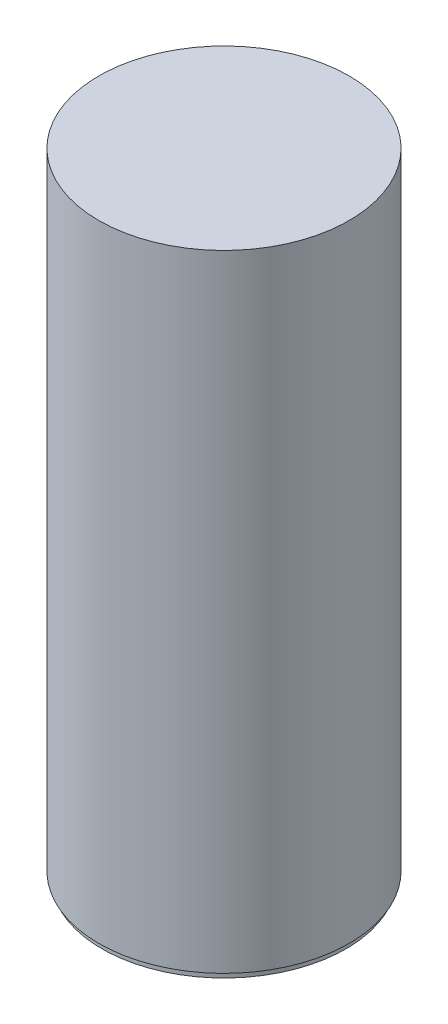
ISO-10303-21;
HEADER;
FILE_DESCRIPTION(('STEP AP214'),'2;1');
FILE_NAME('part.step','',(''),(''),'','','');
FILE_SCHEMA(('AUTOMOTIVE_DESIGN { 1 0 10303 214 1 1 1 1 }'));
ENDSEC;
DATA;
#1=APPLICATION_CONTEXT('core data for automotive mechanical design processes');
#2=APPLICATION_PROTOCOL_DEFINITION('international standard','automotive_design',2000,#1);
#3=PRODUCT_CONTEXT('',#1,'mechanical');
#4=PRODUCT('Part','Part','',(#3));
#5=PRODUCT_RELATED_PRODUCT_CATEGORY('part','',(#4));
#6=PRODUCT_DEFINITION_FORMATION('','',#4);
#7=PRODUCT_DEFINITION_CONTEXT('part definition',#1,'design');
#8=PRODUCT_DEFINITION('design','',#6,#7);
#9=PRODUCT_DEFINITION_SHAPE('','',#8);
#10=(LENGTH_UNIT() NAMED_UNIT(*) SI_UNIT(.MILLI.,.METRE.));
#11=(NAMED_UNIT(*) PLANE_ANGLE_UNIT() SI_UNIT($,.RADIAN.));
#12=(NAMED_UNIT(*) SI_UNIT($,.STERADIAN.) SOLID_ANGLE_UNIT());
#13=UNCERTAINTY_MEASURE_WITH_UNIT(LENGTH_MEASURE(1.E-05),#10,'distance_accuracy_value','');
#14=(GEOMETRIC_REPRESENTATION_CONTEXT(3) GLOBAL_UNCERTAINTY_ASSIGNED_CONTEXT((#13)) GLOBAL_UNIT_ASSIGNED_CONTEXT((#10,
#11,#12)) REPRESENTATION_CONTEXT('',''));
#15=CARTESIAN_POINT('',(0.,0.,0.));
#16=DIRECTION('',(0.,0.,1.));
#17=DIRECTION('',(1.,0.,0.));
#18=AXIS2_PLACEMENT_3D('',#15,#16,#17);
#19=CARTESIAN_POINT('',(0.,100.,0.));
#20=DIRECTION('',(0.,-1.,0.));
#21=DIRECTION('',(0.,0.,-1.));
#22=AXIS2_PLACEMENT_3D('',#19,#20,#21);
#23=CYLINDRICAL_SURFACE('',#22,20.);
#24=CARTESIAN_POINT('',(0.,100.,0.));
#25=DIRECTION('',(0.,1.,0.));
#26=DIRECTION('',(0.,0.,1.));
#27=AXIS2_PLACEMENT_3D('',#24,#25,#26);
#28=CIRCLE('',#27,20.);
#29=CARTESIAN_POINT('',(0.,100.,20.));
#30=VERTEX_POINT('',#29);
#31=EDGE_CURVE('E49',#30,#30,#28,.T.);
#32=ORIENTED_EDGE('',*,*,#31,.F.);
#33=EDGE_LOOP('',(#32));
#34=FACE_BOUND('',#33,.T.);
#35=CARTESIAN_POINT('',(0.,0.,0.));
#36=DIRECTION('',(0.,1.,0.));
#37=DIRECTION('',(0.,0.,1.));
#38=AXIS2_PLACEMENT_3D('',#35,#36,#37);
#39=CIRCLE('',#38,20.);
#40=CARTESIAN_POINT('',(0.,0.,20.));
#41=VERTEX_POINT('',#40);
#42=EDGE_CURVE('E44',#41,#41,#39,.T.);
#43=ORIENTED_EDGE('',*,*,#42,.T.);
#44=EDGE_LOOP('',(#43));
#45=FACE_BOUND('',#44,.T.);
#46=ADVANCED_FACE('F41',(#34,#45),#23,.T.);
#47=CARTESIAN_POINT('',(0.,100.,0.));
#48=DIRECTION('',(0.,1.,0.));
#49=DIRECTION('',(0.,0.,1.));
#50=AXIS2_PLACEMENT_3D('',#47,#48,#49);
#51=PLANE('',#50);
#52=ORIENTED_EDGE('',*,*,#31,.T.);
#53=EDGE_LOOP('',(#52));
#54=FACE_BOUND('',#53,.T.);
#55=ADVANCED_FACE('F84',(#54),#51,.T.);
#56=CARTESIAN_POINT('',(0.,0.,0.));
#57=DIRECTION('',(0.,1.,0.));
#58=DIRECTION('',(0.,0.,1.));
#59=AXIS2_PLACEMENT_3D('',#56,#57,#58);
#60=PLANE('',#59);
#61=CARTESIAN_POINT('',(0.,0.,0.));
#62=DIRECTION('',(0.,-1.,0.));
#63=DIRECTION('',(0.,0.,-1.));
#64=AXIS2_PLACEMENT_3D('',#61,#62,#63);
#65=CIRCLE('',#64,19.4969621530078);
#66=CARTESIAN_POINT('',(0.,0.,-19.4969621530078));
#67=VERTEX_POINT('',#66);
#68=EDGE_CURVE('E10',#67,#67,#65,.T.);
#69=ORIENTED_EDGE('',*,*,#68,.F.);
#70=EDGE_LOOP('',(#69));
#71=FACE_BOUND('',#70,.T.);
#72=ORIENTED_EDGE('',*,*,#42,.F.);
#73=EDGE_LOOP('',(#72));
#74=FACE_BOUND('',#73,.T.);
#75=ADVANCED_FACE('F79',(#71,#74),#60,.F.);
#76=CARTESIAN_POINT('',(0.,-1.,0.));
#77=DIRECTION('',(0.,1.,0.));
#78=DIRECTION('',(0.,0.,1.));
#79=AXIS2_PLACEMENT_3D('',#76,#77,#78);
#80=CYLINDRICAL_SURFACE('',#79,19.4969621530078);
#81=CARTESIAN_POINT('',(0.,-1.,0.));
#82=DIRECTION('',(0.,-1.,0.));
#83=DIRECTION('',(0.,0.,-1.));
#84=AXIS2_PLACEMENT_3D('',#81,#82,#83);
#85=CIRCLE('',#84,19.4969621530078);
#86=CARTESIAN_POINT('',(0.,-1.,-19.4969621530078));
#87=VERTEX_POINT('',#86);
#88=EDGE_CURVE('E56',#87,#87,#85,.T.);
#89=ORIENTED_EDGE('',*,*,#88,.F.);
#90=EDGE_LOOP('',(#89));
#91=FACE_BOUND('',#90,.T.);
#92=ORIENTED_EDGE('',*,*,#68,.T.);
#93=EDGE_LOOP('',(#92));
#94=FACE_BOUND('',#93,.T.);
#95=ADVANCED_FACE('F74',(#91,#94),#80,.T.);
#96=CARTESIAN_POINT('',(0.,-1.,0.));
#97=DIRECTION('',(0.,-1.,0.));
#98=DIRECTION('',(0.,0.,-1.));
#99=AXIS2_PLACEMENT_3D('',#96,#97,#98);
#100=PLANE('',#99);
#101=CARTESIAN_POINT('',(0.,-1.,0.));
#102=DIRECTION('',(0.,-1.,0.));
#103=DIRECTION('',(0.,0.,-1.));
#104=AXIS2_PLACEMENT_3D('',#101,#102,#103);
#105=CIRCLE('',#104,17.5599962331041);
#106=CARTESIAN_POINT('',(0.,-1.,-17.5599962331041));
#107=VERTEX_POINT('',#106);
#108=EDGE_CURVE('E64',#107,#107,#105,.T.);
#109=ORIENTED_EDGE('',*,*,#108,.F.);
#110=EDGE_LOOP('',(#109));
#111=FACE_BOUND('',#110,.T.);
#112=ORIENTED_EDGE('',*,*,#88,.T.);
#113=EDGE_LOOP('',(#112));
#114=FACE_BOUND('',#113,.T.);
#115=ADVANCED_FACE('F71',(#111,#114),#100,.T.);
#116=CARTESIAN_POINT('',(0.,-1.,0.));
#117=DIRECTION('',(0.,-1.,0.));
#118=DIRECTION('',(0.,0.,-1.));
#119=AXIS2_PLACEMENT_3D('',#116,#117,#118);
#120=CONICAL_SURFACE('',#119,17.5599962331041,0.383972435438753);
#121=CARTESIAN_POINT('',(0.,6.,0.));
#122=DIRECTION('',(0.,-1.,0.));
#123=DIRECTION('',(0.,0.,-1.));
#124=AXIS2_PLACEMENT_3D('',#121,#122,#123);
#125=CIRCLE('',#124,14.731812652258);
#126=CARTESIAN_POINT('',(0.,6.,-14.731812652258));
#127=VERTEX_POINT('',#126);
#128=EDGE_CURVE('E60',#127,#127,#125,.T.);
#129=ORIENTED_EDGE('',*,*,#128,.F.);
#130=EDGE_LOOP('',(#129));
#131=FACE_BOUND('',#130,.T.);
#132=ORIENTED_EDGE('',*,*,#108,.T.);
#133=EDGE_LOOP('',(#132));
#134=FACE_BOUND('',#133,.T.);
#135=ADVANCED_FACE('F69',(#131,#134),#120,.F.);
#136=CARTESIAN_POINT('',(0.,6.,0.));
#137=DIRECTION('',(0.,-1.,0.));
#138=DIRECTION('',(0.,0.,-1.));
#139=AXIS2_PLACEMENT_3D('',#136,#137,#138);
#140=PLANE('',#139);
#141=ORIENTED_EDGE('',*,*,#128,.T.);
#142=EDGE_LOOP('',(#141));
#143=FACE_BOUND('',#142,.T.);
#144=ADVANCED_FACE('F127',(#143),#140,.T.);
#145=CLOSED_SHELL('',(#46,#55,#75,#95,#115,#135,#144));
#146=MANIFOLD_SOLID_BREP('B2',#145);
#147=ADVANCED_BREP_SHAPE_REPRESENTATION('',(#18,#146),#14);
#148=SHAPE_DEFINITION_REPRESENTATION(#9,#147);
ENDSEC;
END-ISO-10303-21;
